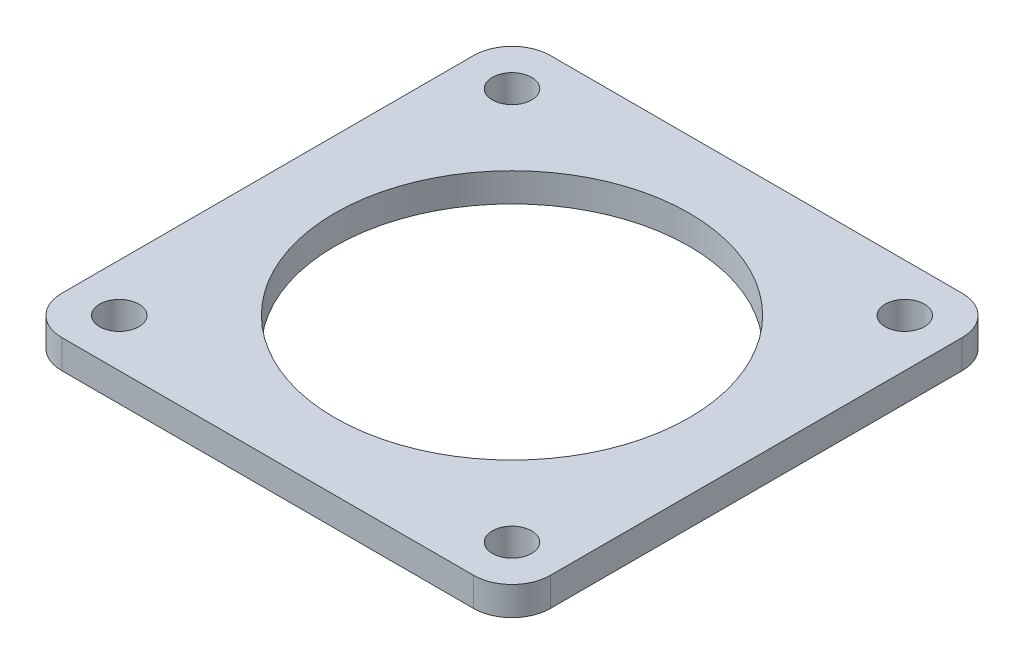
from build123d import *

# Parameters (mm, degrees)
SKETCH1_W                  = 51
SKETCH1_H                  = 51
BOSS_EXTRUDE2_DEPTH        = 3
SKETCH5_R                  = 18.5
CUT_EXTRUDE2_DEPTH         = 37.187014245
F_4_1_4_1_DIAMETER_HOLE1_D = 4.1
FILLET1_R                  = 4


with BuildPart() as part:
    # Sketch1 → Boss-Extrude2 (new body)
    with BuildSketch(Plane(origin=(0, 0, 0), x_dir=(1, 0, 0), z_dir=(0, 1, 0))):
        Rectangle(SKETCH1_W, SKETCH1_H)
    extrude(amount=BOSS_EXTRUDE2_DEPTH)

    # Sketch5 → Cut-Extrude2 (cut, through all)
    with BuildSketch(Plane(origin=(0, 3, 0), x_dir=(1, 0, 0), z_dir=(0, 1, 0))):
        with Locations(Location((0, 0, 0), (0, 0, 270))):
            Circle(SKETCH5_R)
    extrude(amount=-CUT_EXTRUDE2_DEPTH, mode=Mode.SUBTRACT)

    # 4.1 _4.1_ Diameter Hole1 (through all)
    with Locations(Plane(origin=(0, 3, 0), x_dir=(1, 0, 0), z_dir=(0, 1, 0))):
        with Locations((-20.5, 20.5), (20.5, 20.5), (20.5, -20.5), (-20.5, -20.5)):
            Hole(F_4_1_4_1_DIAMETER_HOLE1_D / 2)

    # Fillet1
    fillet1_edges = [part.edges().sort_by_distance(p)[0] for p in [
        (25.5, 1.5, 25.5),
        (-25.5, 1.5, 25.5),
        (-25.5, 1.5, -25.5),
        (25.5, 1.5, -25.5),
    ]]
    fillet(fillet1_edges, radius=FILLET1_R)


solid = part.part
